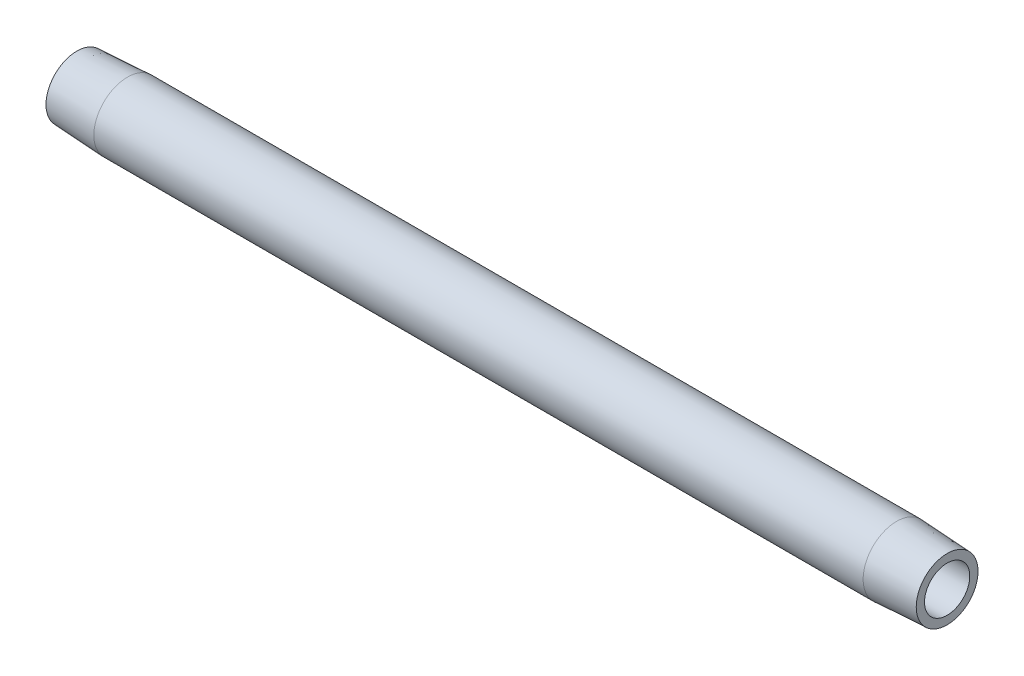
from build123d import *


with BuildPart() as part:
    # Sketch1 → Revolve1 (revolve)
    with BuildSketch(Plane(origin=(0, 0, 0), x_dir=(1, 0, 0), z_dir=(0, 1, 0)), mode=Mode.PRIVATE) as revolve1_sk:
        Polygon((177.8, 4.622776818), (0, 4.622776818), (0, 6.317526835), (10.3124, 6.857976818), (167.4876, 6.857976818), (177.8, 6.317526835), align=None)
    revolve(revolve1_sk.sketch.rotate(Axis((-6.375994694, 0, 0), (1, 0, 0)), 180), axis=Axis((-6.375994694, 0, 0), (1, 0, 0)))


solid = part.part
